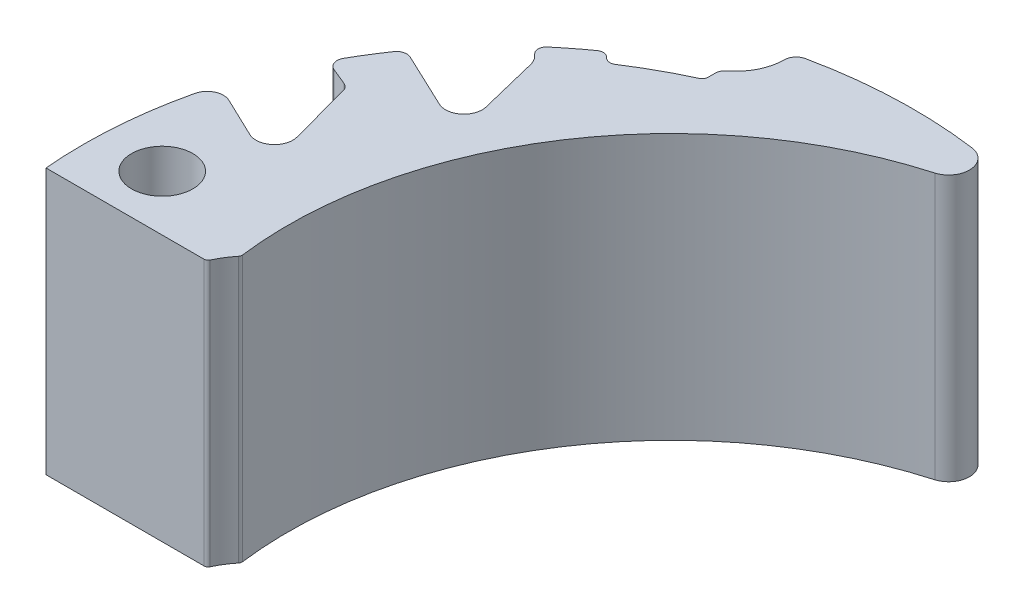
from build123d import *

# Parameters (mm, degrees)
BOSS_EXTRUDE1_DEPTH = 13


with BuildPart() as part:
    # Sketch1 → Boss-Extrude1 (new body)
    with BuildSketch(Plane(origin=(0, 0, 0), x_dir=(1, 0, 0), z_dir=(0, 1, 0))):
        with BuildLine():
            Line((121.203265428, 145.197501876), (119.235666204, 146.138680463))
            ThreePointArc((119.235666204, 146.138680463), (118.544754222, 146.138444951), (118.111692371, 145.600098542))
            ThreePointArc((118.111692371, 145.600098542), (117.597259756, 142.217178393), (117.628461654, 138.795509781))
            Line((117.628461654, 138.795509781), (125.366202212, 138.795509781))
            ThreePointArc((125.366202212, 138.795509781), (125.473848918, 138.826950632), (125.547650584, 138.911387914))
            ThreePointArc((125.547650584, 138.911387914), (125.787961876, 139.355021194), (126.081562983, 139.765336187))
            ThreePointArc((126.081562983, 139.765336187), (126.118789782, 139.836704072), (126.124865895, 139.916967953))
            ThreePointArc((126.124865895, 139.916967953), (129.062641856, 152.60279327), (139.553848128, 160.316111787))
            ThreePointArc((139.553848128, 160.316111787), (139.574190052, 160.321934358), (139.594538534, 160.327733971))
            ThreePointArc((139.594538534, 160.327733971), (140.306702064, 161.380224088), (139.432329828, 162.302387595))
            ThreePointArc((139.432329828, 162.302387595), (135.488270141, 162.494897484), (131.569829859, 162.006540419))
            ThreePointArc((131.569829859, 162.006540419), (131.239868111, 161.80475511), (131.109080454, 161.440767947))
            ThreePointArc((131.109080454, 161.440767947), (130.860637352, 160.39794485), (130.179324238, 159.570287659))
            ThreePointArc((130.179324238, 159.570287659), (130.035314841, 159.3947683), (129.983769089, 159.173660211))
            Line((129.983769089, 159.173660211), (129.983769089, 158.839172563))
            ThreePointArc((129.983769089, 158.839172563), (129.936006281, 158.676764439), (129.807926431, 158.566070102))
            ThreePointArc((129.807926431, 158.566070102), (128.467967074, 157.893758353), (127.183464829, 157.120745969))
            ThreePointArc((127.183464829, 157.120745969), (126.912871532, 157.058620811), (126.667017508, 157.187601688))
            Line((126.667017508, 157.187601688), (126.662791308, 157.192293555))
            ThreePointArc((126.662791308, 157.192293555), (126.409015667, 157.322219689), (126.13317623, 157.250140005))
            ThreePointArc((126.13317623, 157.250140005), (125.438055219, 156.731072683), (124.765804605, 156.182708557))
            ThreePointArc((124.765804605, 156.182708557), (124.625540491, 155.89417919), (124.742380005, 155.595395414))
            Line((124.742380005, 155.595395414), (124.838741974, 155.499033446))
            ThreePointArc((124.838741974, 155.499033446), (125.002817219, 155.282886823), (125.102738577, 155.030585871))
            Line((125.102738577, 155.030585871), (125.810708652, 152.149858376))
            ThreePointArc((125.810708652, 152.149858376), (125.506162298, 151.238121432), (124.552015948, 151.121427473))
            Line((124.552015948, 151.121427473), (121.835104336, 152.40602266))
            ThreePointArc((121.835104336, 152.40602266), (121.491132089, 152.436738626), (121.209294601, 152.23716907))
            ThreePointArc((121.209294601, 152.23716907), (120.718487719, 151.487930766), (120.261292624, 150.717721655))
            ThreePointArc((120.261292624, 150.717721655), (120.224470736, 150.308008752), (120.507351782, 150.009347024))
            Line((120.507351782, 150.009347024), (121.334184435, 149.670847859))
            ThreePointArc((121.334184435, 149.670847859), (121.519794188, 149.538790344), (121.627559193, 149.338099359))
            Line((121.627559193, 149.338099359), (122.460686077, 146.243354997))
            ThreePointArc((122.460686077, 146.243354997), (122.167143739, 145.317458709), (121.203265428, 145.197501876))
        make_face()
    extrude(amount=BOSS_EXTRUDE1_DEPTH)

    # Schizzo3 → Taglia-Rivoluzione1 (revolve, cut)
    with BuildSketch(Plane.XY.offset(-141.5), mode=Mode.PRIVATE) as taglia_rivoluzione1_sk:
        Polygon((119.110185, 13), (120.610185, 13), (120.610185, 0), (119.110185, 0), (119.110185, 4.5), (119.860185, 5), (119.860185, 8), (119.110185, 8.5), align=None)
    revolve(taglia_rivoluzione1_sk.sketch.rotate(Axis((120.610185, 13, -141.5), (0, -1, 0)), 270), axis=Axis((120.610185, 13, -141.5), (0, -1, 0)), mode=Mode.SUBTRACT)


solid = part.part
